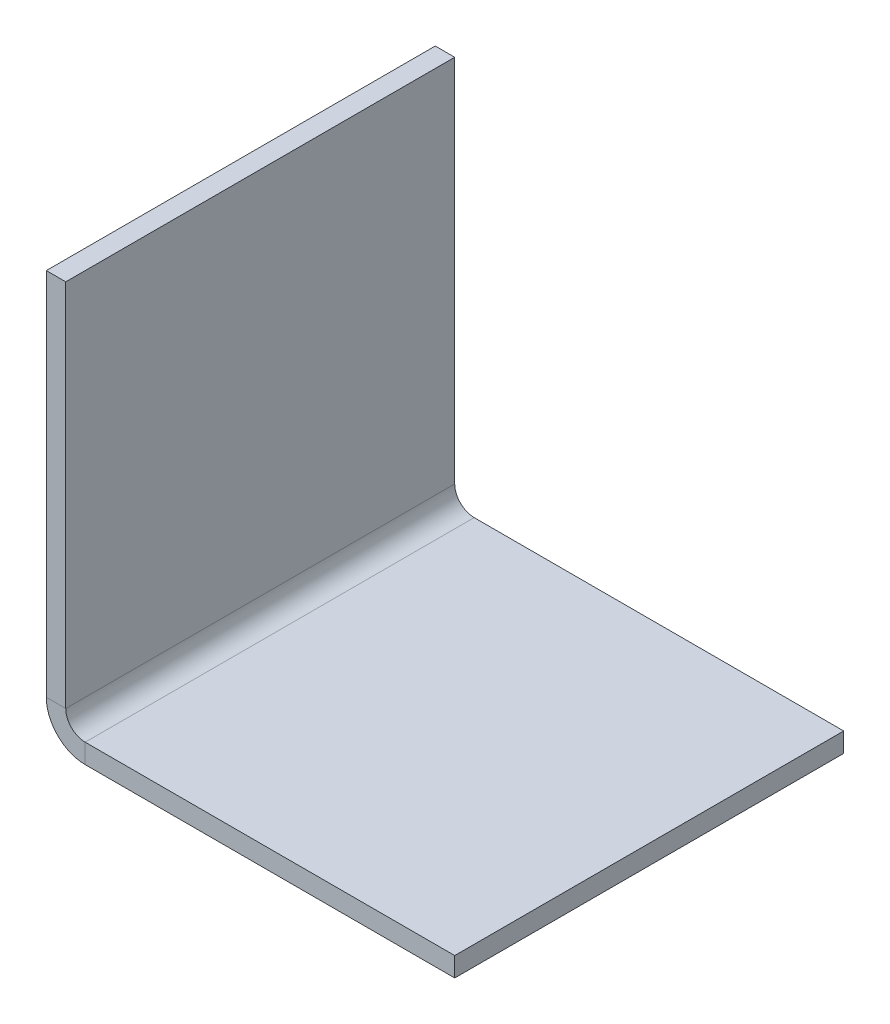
ISO-10303-21;
HEADER;
FILE_DESCRIPTION(('STEP AP214'),'2;1');
FILE_NAME('part.step','',(''),(''),'','','');
FILE_SCHEMA(('AUTOMOTIVE_DESIGN { 1 0 10303 214 1 1 1 1 }'));
ENDSEC;
DATA;
#1=APPLICATION_CONTEXT('core data for automotive mechanical design processes');
#2=APPLICATION_PROTOCOL_DEFINITION('international standard','automotive_design',2000,#1);
#3=PRODUCT_CONTEXT('',#1,'mechanical');
#4=PRODUCT('Part','Part','',(#3));
#5=PRODUCT_RELATED_PRODUCT_CATEGORY('part','',(#4));
#6=PRODUCT_DEFINITION_FORMATION('','',#4);
#7=PRODUCT_DEFINITION_CONTEXT('part definition',#1,'design');
#8=PRODUCT_DEFINITION('design','',#6,#7);
#9=PRODUCT_DEFINITION_SHAPE('','',#8);
#10=(LENGTH_UNIT() NAMED_UNIT(*) SI_UNIT(.MILLI.,.METRE.));
#11=(NAMED_UNIT(*) PLANE_ANGLE_UNIT() SI_UNIT($,.RADIAN.));
#12=(NAMED_UNIT(*) SI_UNIT($,.STERADIAN.) SOLID_ANGLE_UNIT());
#13=UNCERTAINTY_MEASURE_WITH_UNIT(LENGTH_MEASURE(1.E-05),#10,'distance_accuracy_value','');
#14=(GEOMETRIC_REPRESENTATION_CONTEXT(3) GLOBAL_UNCERTAINTY_ASSIGNED_CONTEXT((#13)) GLOBAL_UNIT_ASSIGNED_CONTEXT((#10,
#11,#12)) REPRESENTATION_CONTEXT('',''));
#15=CARTESIAN_POINT('',(0.,0.,0.));
#16=DIRECTION('',(0.,0.,1.));
#17=DIRECTION('',(1.,0.,0.));
#18=AXIS2_PLACEMENT_3D('',#15,#16,#17);
#19=CARTESIAN_POINT('',(-50.,5.,-50.));
#20=DIRECTION('',(0.,0.,1.));
#21=DIRECTION('',(1.,0.,0.));
#22=AXIS2_PLACEMENT_3D('',#19,#20,#21);
#23=PLANE('',#22);
#24=DIRECTION('',(0.,-1.,0.));
#25=VECTOR('',#24,1.);
#26=CARTESIAN_POINT('',(-45.,5.,-50.));
#27=LINE('',#26,#25);
#28=CARTESIAN_POINT('',(-45.,5.,-50.));
#29=VERTEX_POINT('',#28);
#30=CARTESIAN_POINT('',(-45.,0.,-50.));
#31=VERTEX_POINT('',#30);
#32=EDGE_CURVE('E55',#29,#31,#27,.T.);
#33=ORIENTED_EDGE('',*,*,#32,.F.);
#34=DIRECTION('',(-1.,0.,0.));
#35=VECTOR('',#34,1.);
#36=CARTESIAN_POINT('',(-50.,5.,-50.));
#37=LINE('',#36,#35);
#38=CARTESIAN_POINT('',(50.,5.,-50.));
#39=VERTEX_POINT('',#38);
#40=EDGE_CURVE('E163',#39,#29,#37,.T.);
#41=ORIENTED_EDGE('',*,*,#40,.F.);
#42=DIRECTION('',(0.,-1.,0.));
#43=VECTOR('',#42,1.);
#44=CARTESIAN_POINT('',(50.,5.,-50.));
#45=LINE('',#44,#43);
#46=CARTESIAN_POINT('',(50.,0.,-50.));
#47=VERTEX_POINT('',#46);
#48=EDGE_CURVE('E11',#39,#47,#45,.T.);
#49=ORIENTED_EDGE('',*,*,#48,.T.);
#50=DIRECTION('',(-1.,0.,0.));
#51=VECTOR('',#50,1.);
#52=CARTESIAN_POINT('',(-50.,0.,-50.));
#53=LINE('',#52,#51);
#54=EDGE_CURVE('E170',#47,#31,#53,.T.);
#55=ORIENTED_EDGE('',*,*,#54,.T.);
#56=EDGE_LOOP('',(#33,#41,#49,#55));
#57=FACE_BOUND('',#56,.T.);
#58=ADVANCED_FACE('F32',(#57),#23,.F.);
#59=CARTESIAN_POINT('',(-50.,5.,50.));
#60=DIRECTION('',(0.,0.,-1.));
#61=DIRECTION('',(-1.,0.,0.));
#62=AXIS2_PLACEMENT_3D('',#59,#60,#61);
#63=PLANE('',#62);
#64=DIRECTION('',(0.,-1.,0.));
#65=VECTOR('',#64,1.);
#66=CARTESIAN_POINT('',(-45.,5.,50.));
#67=LINE('',#66,#65);
#68=CARTESIAN_POINT('',(-45.,5.,50.));
#69=VERTEX_POINT('',#68);
#70=CARTESIAN_POINT('',(-45.,0.,50.));
#71=VERTEX_POINT('',#70);
#72=EDGE_CURVE('E151',#69,#71,#67,.T.);
#73=ORIENTED_EDGE('',*,*,#72,.T.);
#74=DIRECTION('',(1.,0.,0.));
#75=VECTOR('',#74,1.);
#76=CARTESIAN_POINT('',(-50.,0.,50.));
#77=LINE('',#76,#75);
#78=CARTESIAN_POINT('',(50.,0.,50.));
#79=VERTEX_POINT('',#78);
#80=EDGE_CURVE('E164',#71,#79,#77,.T.);
#81=ORIENTED_EDGE('',*,*,#80,.T.);
#82=DIRECTION('',(0.,-1.,0.));
#83=VECTOR('',#82,1.);
#84=CARTESIAN_POINT('',(50.,5.,50.));
#85=LINE('',#84,#83);
#86=CARTESIAN_POINT('',(50.,5.,50.));
#87=VERTEX_POINT('',#86);
#88=EDGE_CURVE('E40',#87,#79,#85,.T.);
#89=ORIENTED_EDGE('',*,*,#88,.F.);
#90=DIRECTION('',(1.,0.,0.));
#91=VECTOR('',#90,1.);
#92=CARTESIAN_POINT('',(-50.,5.,50.));
#93=LINE('',#92,#91);
#94=EDGE_CURVE('E166',#69,#87,#93,.T.);
#95=ORIENTED_EDGE('',*,*,#94,.F.);
#96=EDGE_LOOP('',(#73,#81,#89,#95));
#97=FACE_BOUND('',#96,.T.);
#98=ADVANCED_FACE('F183',(#97),#63,.F.);
#99=CARTESIAN_POINT('',(50.,5.,50.));
#100=DIRECTION('',(0.,1.,0.));
#101=DIRECTION('',(0.,0.,1.));
#102=AXIS2_PLACEMENT_3D('',#99,#100,#101);
#103=PLANE('',#102);
#104=ORIENTED_EDGE('',*,*,#40,.T.);
#105=DIRECTION('',(0.,0.,1.));
#106=VECTOR('',#105,1.);
#107=CARTESIAN_POINT('',(-45.,5.,50.));
#108=LINE('',#107,#106);
#109=EDGE_CURVE('E47',#69,#29,#108,.F.);
#110=ORIENTED_EDGE('',*,*,#109,.F.);
#111=ORIENTED_EDGE('',*,*,#94,.T.);
#112=DIRECTION('',(0.,0.,-1.));
#113=VECTOR('',#112,1.);
#114=CARTESIAN_POINT('',(50.,5.,-50.));
#115=LINE('',#114,#113);
#116=EDGE_CURVE('E160',#87,#39,#115,.T.);
#117=ORIENTED_EDGE('',*,*,#116,.T.);
#118=EDGE_LOOP('',(#104,#110,#111,#117));
#119=FACE_BOUND('',#118,.T.);
#120=ADVANCED_FACE('F182',(#119),#103,.T.);
#121=CARTESIAN_POINT('',(50.,0.,50.));
#122=DIRECTION('',(0.,1.,0.));
#123=DIRECTION('',(0.,0.,1.));
#124=AXIS2_PLACEMENT_3D('',#121,#122,#123);
#125=PLANE('',#124);
#126=DIRECTION('',(0.,0.,1.));
#127=VECTOR('',#126,1.);
#128=CARTESIAN_POINT('',(-45.,0.,50.));
#129=LINE('',#128,#127);
#130=EDGE_CURVE('E105',#71,#31,#129,.F.);
#131=ORIENTED_EDGE('',*,*,#130,.T.);
#132=ORIENTED_EDGE('',*,*,#54,.F.);
#133=DIRECTION('',(0.,0.,-1.));
#134=VECTOR('',#133,1.);
#135=CARTESIAN_POINT('',(50.,0.,-50.));
#136=LINE('',#135,#134);
#137=EDGE_CURVE('E158',#79,#47,#136,.T.);
#138=ORIENTED_EDGE('',*,*,#137,.F.);
#139=ORIENTED_EDGE('',*,*,#80,.F.);
#140=EDGE_LOOP('',(#131,#132,#138,#139));
#141=FACE_BOUND('',#140,.T.);
#142=ADVANCED_FACE('F181',(#141),#125,.F.);
#143=CARTESIAN_POINT('',(50.,5.,-50.));
#144=DIRECTION('',(-1.,0.,0.));
#145=DIRECTION('',(0.,0.,1.));
#146=AXIS2_PLACEMENT_3D('',#143,#144,#145);
#147=PLANE('',#146);
#148=ORIENTED_EDGE('',*,*,#137,.T.);
#149=ORIENTED_EDGE('',*,*,#48,.F.);
#150=ORIENTED_EDGE('',*,*,#116,.F.);
#151=ORIENTED_EDGE('',*,*,#88,.T.);
#152=EDGE_LOOP('',(#148,#149,#150,#151));
#153=FACE_BOUND('',#152,.T.);
#154=ADVANCED_FACE('F34',(#153),#147,.F.);
#155=CARTESIAN_POINT('',(-45.,10.,-50.));
#156=DIRECTION('',(0.,0.,-1.));
#157=DIRECTION('',(-1.,0.,0.));
#158=AXIS2_PLACEMENT_3D('',#155,#156,#157);
#159=PLANE('',#158);
#160=DIRECTION('',(-1.,0.,0.));
#161=VECTOR('',#160,1.);
#162=CARTESIAN_POINT('',(-50.,9.99999999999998,-50.));
#163=LINE('',#162,#161);
#164=CARTESIAN_POINT('',(-50.,9.99999999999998,-50.));
#165=VERTEX_POINT('',#164);
#166=CARTESIAN_POINT('',(-55.,9.99999999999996,-50.));
#167=VERTEX_POINT('',#166);
#168=EDGE_CURVE('E190',#165,#167,#163,.T.);
#169=ORIENTED_EDGE('',*,*,#168,.F.);
#170=CARTESIAN_POINT('',(-45.,10.,-50.));
#171=DIRECTION('',(0.,0.,1.));
#172=DIRECTION('',(1.,0.,0.));
#173=AXIS2_PLACEMENT_3D('',#170,#171,#172);
#174=CIRCLE('',#173,5.);
#175=EDGE_CURVE('E108',#29,#165,#174,.F.);
#176=ORIENTED_EDGE('',*,*,#175,.F.);
#177=ORIENTED_EDGE('',*,*,#32,.T.);
#178=CARTESIAN_POINT('',(-45.,10.,-50.));
#179=DIRECTION('',(0.,0.,1.));
#180=DIRECTION('',(1.,0.,0.));
#181=AXIS2_PLACEMENT_3D('',#178,#179,#180);
#182=CIRCLE('',#181,10.);
#183=EDGE_CURVE('E150',#31,#167,#182,.F.);
#184=ORIENTED_EDGE('',*,*,#183,.T.);
#185=EDGE_LOOP('',(#169,#176,#177,#184));
#186=FACE_BOUND('',#185,.T.);
#187=ADVANCED_FACE('F197',(#186),#159,.T.);
#188=CARTESIAN_POINT('',(-45.,10.,50.));
#189=DIRECTION('',(0.,0.,-1.));
#190=DIRECTION('',(-1.,0.,0.));
#191=AXIS2_PLACEMENT_3D('',#188,#189,#190);
#192=PLANE('',#191);
#193=CARTESIAN_POINT('',(-45.,10.,50.));
#194=DIRECTION('',(0.,0.,1.));
#195=DIRECTION('',(1.,0.,0.));
#196=AXIS2_PLACEMENT_3D('',#193,#194,#195);
#197=CIRCLE('',#196,5.);
#198=CARTESIAN_POINT('',(-50.,9.99999999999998,50.));
#199=VERTEX_POINT('',#198);
#200=EDGE_CURVE('E115',#199,#69,#197,.T.);
#201=ORIENTED_EDGE('',*,*,#200,.F.);
#202=DIRECTION('',(-1.,0.,0.));
#203=VECTOR('',#202,1.);
#204=CARTESIAN_POINT('',(-50.,9.99999999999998,50.));
#205=LINE('',#204,#203);
#206=CARTESIAN_POINT('',(-55.,9.99999999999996,50.));
#207=VERTEX_POINT('',#206);
#208=EDGE_CURVE('E112',#199,#207,#205,.T.);
#209=ORIENTED_EDGE('',*,*,#208,.T.);
#210=CARTESIAN_POINT('',(-45.,10.,50.));
#211=DIRECTION('',(0.,0.,1.));
#212=DIRECTION('',(1.,0.,0.));
#213=AXIS2_PLACEMENT_3D('',#210,#211,#212);
#214=CIRCLE('',#213,10.);
#215=EDGE_CURVE('E98',#207,#71,#214,.T.);
#216=ORIENTED_EDGE('',*,*,#215,.T.);
#217=ORIENTED_EDGE('',*,*,#72,.F.);
#218=EDGE_LOOP('',(#201,#209,#216,#217));
#219=FACE_BOUND('',#218,.T.);
#220=ADVANCED_FACE('F113',(#219),#192,.F.);
#221=CARTESIAN_POINT('',(-45.,10.,50.));
#222=DIRECTION('',(0.,0.,1.));
#223=DIRECTION('',(-1.,0.,0.));
#224=AXIS2_PLACEMENT_3D('',#221,#222,#223);
#225=CYLINDRICAL_SURFACE('',#224,10.);
#226=ORIENTED_EDGE('',*,*,#130,.F.);
#227=ORIENTED_EDGE('',*,*,#215,.F.);
#228=DIRECTION('',(0.,0.,-1.));
#229=VECTOR('',#228,1.);
#230=CARTESIAN_POINT('',(-55.,9.99999999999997,-50.));
#231=LINE('',#230,#229);
#232=EDGE_CURVE('E103',#207,#167,#231,.T.);
#233=ORIENTED_EDGE('',*,*,#232,.T.);
#234=ORIENTED_EDGE('',*,*,#183,.F.);
#235=EDGE_LOOP('',(#226,#227,#233,#234));
#236=FACE_BOUND('',#235,.T.);
#237=ADVANCED_FACE('F100',(#236),#225,.T.);
#238=CARTESIAN_POINT('',(-45.,10.,50.));
#239=DIRECTION('',(0.,0.,1.));
#240=DIRECTION('',(-1.,0.,0.));
#241=AXIS2_PLACEMENT_3D('',#238,#239,#240);
#242=CYLINDRICAL_SURFACE('',#241,5.);
#243=ORIENTED_EDGE('',*,*,#109,.T.);
#244=ORIENTED_EDGE('',*,*,#175,.T.);
#245=DIRECTION('',(0.,0.,1.));
#246=VECTOR('',#245,1.);
#247=CARTESIAN_POINT('',(-50.,9.99999999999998,-50.));
#248=LINE('',#247,#246);
#249=EDGE_CURVE('E119',#165,#199,#248,.T.);
#250=ORIENTED_EDGE('',*,*,#249,.T.);
#251=ORIENTED_EDGE('',*,*,#200,.T.);
#252=EDGE_LOOP('',(#243,#244,#250,#251));
#253=FACE_BOUND('',#252,.T.);
#254=ADVANCED_FACE('F185',(#253),#242,.F.);
#255=CARTESIAN_POINT('',(-55.,4.99999999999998,-50.));
#256=DIRECTION('',(0.,0.,1.));
#257=DIRECTION('',(1.,0.,0.));
#258=AXIS2_PLACEMENT_3D('',#255,#256,#257);
#259=PLANE('',#258);
#260=ORIENTED_EDGE('',*,*,#168,.T.);
#261=DIRECTION('',(0.,-1.,0.));
#262=VECTOR('',#261,1.);
#263=CARTESIAN_POINT('',(-55.,4.99999999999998,-50.));
#264=LINE('',#263,#262);
#265=CARTESIAN_POINT('',(-55.0000000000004,105.,-50.));
#266=VERTEX_POINT('',#265);
#267=EDGE_CURVE('E127',#266,#167,#264,.T.);
#268=ORIENTED_EDGE('',*,*,#267,.F.);
#269=DIRECTION('',(1.,0.,0.));
#270=VECTOR('',#269,1.);
#271=CARTESIAN_POINT('',(-55.0000000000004,105.,-50.));
#272=LINE('',#271,#270);
#273=CARTESIAN_POINT('',(-50.0000000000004,105.,-50.));
#274=VERTEX_POINT('',#273);
#275=EDGE_CURVE('E136',#266,#274,#272,.T.);
#276=ORIENTED_EDGE('',*,*,#275,.T.);
#277=DIRECTION('',(0.,-1.,0.));
#278=VECTOR('',#277,1.);
#279=CARTESIAN_POINT('',(-50.,5.,-50.));
#280=LINE('',#279,#278);
#281=EDGE_CURVE('E128',#274,#165,#280,.T.);
#282=ORIENTED_EDGE('',*,*,#281,.T.);
#283=EDGE_LOOP('',(#260,#268,#276,#282));
#284=FACE_BOUND('',#283,.T.);
#285=ADVANCED_FACE('F195',(#284),#259,.F.);
#286=CARTESIAN_POINT('',(-55.0000000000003,105.,50.));
#287=DIRECTION('',(0.,0.,-1.));
#288=DIRECTION('',(-1.,0.,0.));
#289=AXIS2_PLACEMENT_3D('',#286,#287,#288);
#290=PLANE('',#289);
#291=ORIENTED_EDGE('',*,*,#208,.F.);
#292=DIRECTION('',(0.,1.,0.));
#293=VECTOR('',#292,1.);
#294=CARTESIAN_POINT('',(-50.0000000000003,105.,50.));
#295=LINE('',#294,#293);
#296=CARTESIAN_POINT('',(-50.0000000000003,105.,50.));
#297=VERTEX_POINT('',#296);
#298=EDGE_CURVE('E143',#199,#297,#295,.T.);
#299=ORIENTED_EDGE('',*,*,#298,.T.);
#300=DIRECTION('',(1.,0.,0.));
#301=VECTOR('',#300,1.);
#302=CARTESIAN_POINT('',(-55.0000000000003,105.,50.));
#303=LINE('',#302,#301);
#304=CARTESIAN_POINT('',(-55.0000000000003,105.,50.));
#305=VERTEX_POINT('',#304);
#306=EDGE_CURVE('E132',#305,#297,#303,.T.);
#307=ORIENTED_EDGE('',*,*,#306,.F.);
#308=DIRECTION('',(0.,1.,0.));
#309=VECTOR('',#308,1.);
#310=CARTESIAN_POINT('',(-55.0000000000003,105.,50.));
#311=LINE('',#310,#309);
#312=EDGE_CURVE('E124',#207,#305,#311,.T.);
#313=ORIENTED_EDGE('',*,*,#312,.F.);
#314=EDGE_LOOP('',(#291,#299,#307,#313));
#315=FACE_BOUND('',#314,.T.);
#316=ADVANCED_FACE('F130',(#315),#290,.F.);
#317=CARTESIAN_POINT('',(-55.0000000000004,105.,-50.));
#318=DIRECTION('',(1.,0.,0.));
#319=DIRECTION('',(0.,1.,0.));
#320=AXIS2_PLACEMENT_3D('',#317,#318,#319);
#321=PLANE('',#320);
#322=ORIENTED_EDGE('',*,*,#232,.F.);
#323=ORIENTED_EDGE('',*,*,#312,.T.);
#324=DIRECTION('',(0.,0.,-1.));
#325=VECTOR('',#324,1.);
#326=CARTESIAN_POINT('',(-55.0000000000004,105.,-50.));
#327=LINE('',#326,#325);
#328=EDGE_CURVE('E134',#305,#266,#327,.T.);
#329=ORIENTED_EDGE('',*,*,#328,.T.);
#330=ORIENTED_EDGE('',*,*,#267,.T.);
#331=EDGE_LOOP('',(#322,#323,#329,#330));
#332=FACE_BOUND('',#331,.T.);
#333=ADVANCED_FACE('F123',(#332),#321,.F.);
#334=CARTESIAN_POINT('',(-50.0000000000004,105.,-50.));
#335=DIRECTION('',(1.,0.,0.));
#336=DIRECTION('',(0.,1.,0.));
#337=AXIS2_PLACEMENT_3D('',#334,#335,#336);
#338=PLANE('',#337);
#339=ORIENTED_EDGE('',*,*,#298,.F.);
#340=ORIENTED_EDGE('',*,*,#249,.F.);
#341=ORIENTED_EDGE('',*,*,#281,.F.);
#342=DIRECTION('',(0.,0.,-1.));
#343=VECTOR('',#342,1.);
#344=CARTESIAN_POINT('',(-50.0000000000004,105.,-50.));
#345=LINE('',#344,#343);
#346=EDGE_CURVE('E138',#297,#274,#345,.T.);
#347=ORIENTED_EDGE('',*,*,#346,.F.);
#348=EDGE_LOOP('',(#339,#340,#341,#347));
#349=FACE_BOUND('',#348,.T.);
#350=ADVANCED_FACE('F308',(#349),#338,.T.);
#351=CARTESIAN_POINT('',(-55.0000000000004,105.,-50.));
#352=DIRECTION('',(0.,-1.,0.));
#353=DIRECTION('',(1.,0.,0.));
#354=AXIS2_PLACEMENT_3D('',#351,#352,#353);
#355=PLANE('',#354);
#356=ORIENTED_EDGE('',*,*,#346,.T.);
#357=ORIENTED_EDGE('',*,*,#275,.F.);
#358=ORIENTED_EDGE('',*,*,#328,.F.);
#359=ORIENTED_EDGE('',*,*,#306,.T.);
#360=EDGE_LOOP('',(#356,#357,#358,#359));
#361=FACE_BOUND('',#360,.T.);
#362=ADVANCED_FACE('F318',(#361),#355,.F.);
#363=CLOSED_SHELL('',(#58,#98,#120,#142,#154,#187,#220,#237,#254,#285,#316,#333,#350,#362));
#364=MANIFOLD_SOLID_BREP('B2',#363);
#365=ADVANCED_BREP_SHAPE_REPRESENTATION('',(#18,#364),#14);
#366=SHAPE_DEFINITION_REPRESENTATION(#9,#365);
ENDSEC;
END-ISO-10303-21;
